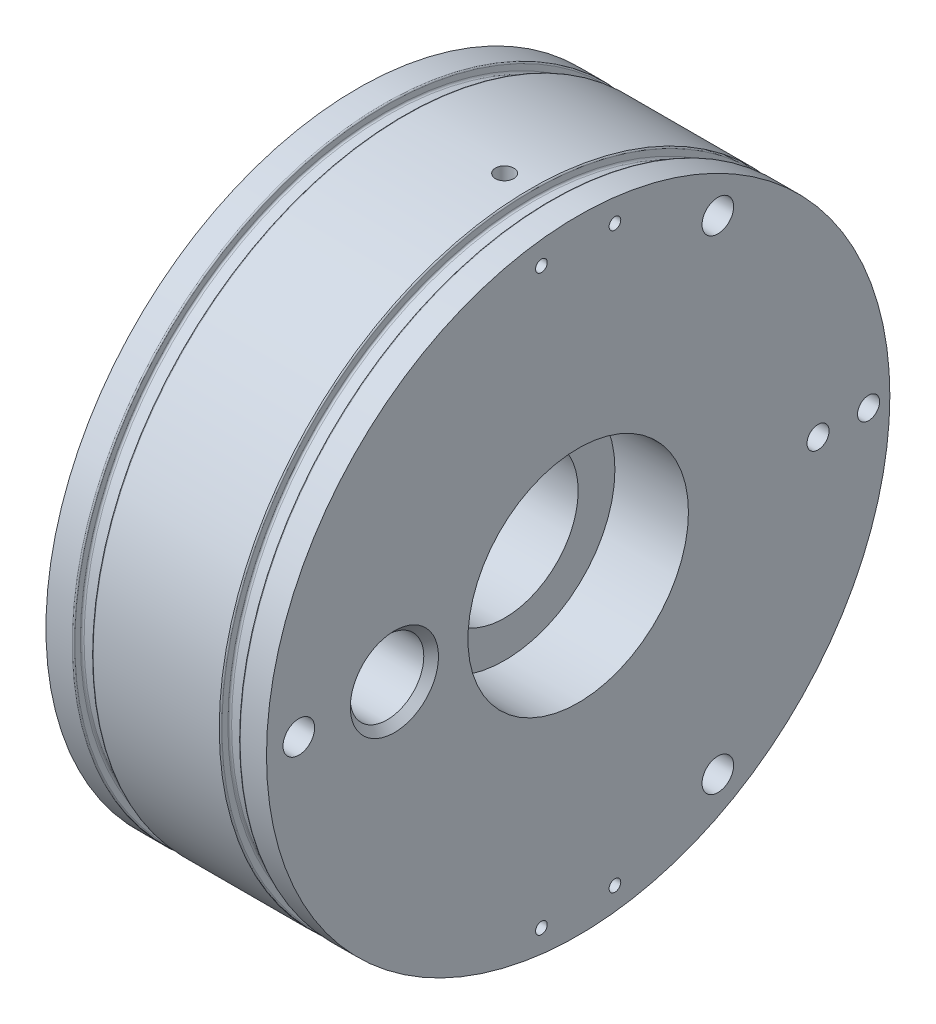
ISO-10303-21;
HEADER;
FILE_DESCRIPTION(('STEP AP214'),'2;1');
FILE_NAME('part.step','',(''),(''),'','','');
FILE_SCHEMA(('AUTOMOTIVE_DESIGN { 1 0 10303 214 1 1 1 1 }'));
ENDSEC;
DATA;
#1=APPLICATION_CONTEXT('core data for automotive mechanical design processes');
#2=APPLICATION_PROTOCOL_DEFINITION('international standard','automotive_design',2000,#1);
#3=PRODUCT_CONTEXT('',#1,'mechanical');
#4=PRODUCT('Part','Part','',(#3));
#5=PRODUCT_RELATED_PRODUCT_CATEGORY('part','',(#4));
#6=PRODUCT_DEFINITION_FORMATION('','',#4);
#7=PRODUCT_DEFINITION_CONTEXT('part definition',#1,'design');
#8=PRODUCT_DEFINITION('design','',#6,#7);
#9=PRODUCT_DEFINITION_SHAPE('','',#8);
#10=(LENGTH_UNIT() NAMED_UNIT(*) SI_UNIT(.MILLI.,.METRE.));
#11=(NAMED_UNIT(*) PLANE_ANGLE_UNIT() SI_UNIT($,.RADIAN.));
#12=(NAMED_UNIT(*) SI_UNIT($,.STERADIAN.) SOLID_ANGLE_UNIT());
#13=UNCERTAINTY_MEASURE_WITH_UNIT(LENGTH_MEASURE(1.E-05),#10,'distance_accuracy_value','');
#14=(GEOMETRIC_REPRESENTATION_CONTEXT(3) GLOBAL_UNCERTAINTY_ASSIGNED_CONTEXT((#13)) GLOBAL_UNIT_ASSIGNED_CONTEXT((#10,
#11,#12)) REPRESENTATION_CONTEXT('',''));
#15=CARTESIAN_POINT('',(0.,0.,0.));
#16=DIRECTION('',(0.,0.,1.));
#17=DIRECTION('',(1.,0.,0.));
#18=AXIS2_PLACEMENT_3D('',#15,#16,#17);
#19=CARTESIAN_POINT('',(30.,0.,0.));
#20=DIRECTION('',(-1.,0.,0.));
#21=DIRECTION('',(0.,0.,1.));
#22=AXIS2_PLACEMENT_3D('',#19,#20,#21);
#23=CYLINDRICAL_SURFACE('',#22,42.4);
#24=CARTESIAN_POINT('',(3.57779637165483,0.,0.));
#25=DIRECTION('',(1.,0.,0.));
#26=DIRECTION('',(0.,0.,-1.));
#27=AXIS2_PLACEMENT_3D('',#24,#25,#26);
#28=CIRCLE('',#27,42.4);
#29=CARTESIAN_POINT('',(3.57779637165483,0.,-42.4));
#30=VERTEX_POINT('',#29);
#31=EDGE_CURVE('E191',#30,#30,#28,.F.);
#32=ORIENTED_EDGE('',*,*,#31,.T.);
#33=EDGE_LOOP('',(#32));
#34=FACE_BOUND('',#33,.T.);
#35=CARTESIAN_POINT('',(0.,0.,0.));
#36=DIRECTION('',(1.,0.,0.));
#37=DIRECTION('',(0.,0.,-1.));
#38=AXIS2_PLACEMENT_3D('',#35,#36,#37);
#39=CIRCLE('',#38,42.4);
#40=CARTESIAN_POINT('',(0.,0.,-42.4));
#41=VERTEX_POINT('',#40);
#42=EDGE_CURVE('E144',#41,#41,#39,.T.);
#43=ORIENTED_EDGE('',*,*,#42,.T.);
#44=EDGE_LOOP('',(#43));
#45=FACE_BOUND('',#44,.T.);
#46=ADVANCED_FACE('F36',(#34,#45),#23,.T.);
#47=CARTESIAN_POINT('',(20.,1.25000000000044,-42.3815702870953));
#48=CARTESIAN_POINT('',(19.9298033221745,1.24999689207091,-42.3815705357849));
#49=CARTESIAN_POINT('',(19.8595561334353,1.24406706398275,-42.3817465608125));
#50=CARTESIAN_POINT('',(19.7209975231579,1.22049471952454,-42.3824318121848));
#51=CARTESIAN_POINT('',(19.6526885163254,1.20283820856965,-42.3829414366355));
#52=CARTESIAN_POINT('',(19.5200336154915,1.15631658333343,-42.3842361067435));
#53=CARTESIAN_POINT('',(19.4556858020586,1.1274569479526,-42.3850210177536));
#54=CARTESIAN_POINT('',(19.3327662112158,1.05935613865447,-42.3867776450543));
#55=CARTESIAN_POINT('',(19.2741930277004,1.02011750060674,-42.3877493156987));
#56=CARTESIAN_POINT('',(19.1644412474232,0.932351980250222,-42.3897704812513));
#57=CARTESIAN_POINT('',(19.1132654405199,0.883821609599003,-42.3908200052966));
#58=CARTESIAN_POINT('',(19.0197845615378,0.778856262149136,-42.3928783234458));
#59=CARTESIAN_POINT('',(18.9774798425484,0.722420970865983,-42.3938871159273));
#60=CARTESIAN_POINT('',(18.9029378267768,0.603237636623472,-42.3957503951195));
#61=CARTESIAN_POINT('',(18.8707021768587,0.54048856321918,-42.3966048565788));
#62=CARTESIAN_POINT('',(18.8172240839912,0.410466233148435,-42.3980629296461));
#63=CARTESIAN_POINT('',(18.7959815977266,0.343192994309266,-42.3986665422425));
#64=CARTESIAN_POINT('',(18.7650987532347,0.206052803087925,-42.3995547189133));
#65=CARTESIAN_POINT('',(18.7554550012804,0.136186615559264,-42.3998393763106));
#66=CARTESIAN_POINT('',(18.7480329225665,-0.00417353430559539,-42.400057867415));
#67=CARTESIAN_POINT('',(18.7502545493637,-0.074667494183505,-42.3999917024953));
#68=CARTESIAN_POINT('',(18.7664972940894,-0.214259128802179,-42.3995160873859));
#69=CARTESIAN_POINT('',(18.7805147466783,-0.283357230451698,-42.3991067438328));
#70=CARTESIAN_POINT('',(18.819945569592,-0.418219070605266,-42.3979910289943));
#71=CARTESIAN_POINT('',(18.8453589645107,-0.483982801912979,-42.3972846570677));
#72=CARTESIAN_POINT('',(18.9068644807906,-0.610320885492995,-42.3956543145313));
#73=CARTESIAN_POINT('',(18.9429582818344,-0.67089441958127,-42.3947303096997));
#74=CARTESIAN_POINT('',(19.0247987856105,-0.785123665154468,-42.392768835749));
#75=CARTESIAN_POINT('',(19.0705455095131,-0.838779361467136,-42.3917313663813));
#76=CARTESIAN_POINT('',(19.1704140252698,-0.937671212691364,-42.3896594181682));
#77=CARTESIAN_POINT('',(19.2245389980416,-0.982904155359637,-42.3886249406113));
#78=CARTESIAN_POINT('',(19.3396163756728,-1.06364176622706,-42.3866760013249));
#79=CARTESIAN_POINT('',(19.4005687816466,-1.09914643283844,-42.3857615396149));
#80=CARTESIAN_POINT('',(19.5275726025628,-1.15941928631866,-42.3841557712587));
#81=CARTESIAN_POINT('',(19.5936240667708,-1.18418736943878,-42.3834644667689));
#82=CARTESIAN_POINT('',(19.7289502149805,-1.22228191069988,-42.3823830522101));
#83=CARTESIAN_POINT('',(19.7982248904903,-1.23560839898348,-42.3819929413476));
#84=CARTESIAN_POINT('',(19.9380030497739,-1.25043751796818,-42.3815580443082));
#85=CARTESIAN_POINT('',(20.0085060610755,-1.25194459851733,-42.3815131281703));
#86=CARTESIAN_POINT('',(20.1487640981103,-1.24310371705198,-42.3817733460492));
#87=CARTESIAN_POINT('',(20.2185191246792,-1.23275576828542,-42.3820784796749));
#88=CARTESIAN_POINT('',(20.3552886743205,-1.20050225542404,-42.3830042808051));
#89=CARTESIAN_POINT('',(20.4223036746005,-1.17859871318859,-42.3836248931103));
#90=CARTESIAN_POINT('',(20.55170549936,-1.12385782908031,-42.3851116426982));
#91=CARTESIAN_POINT('',(20.6140923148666,-1.09102046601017,-42.385977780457));
#92=CARTESIAN_POINT('',(20.7324873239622,-1.01533260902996,-42.3878582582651));
#93=CARTESIAN_POINT('',(20.7884936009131,-0.9724791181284,-42.3888726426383));
#94=CARTESIAN_POINT('',(20.8925184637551,-0.877979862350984,-42.390935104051));
#95=CARTESIAN_POINT('',(20.9405370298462,-0.826334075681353,-42.391983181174));
#96=CARTESIAN_POINT('',(21.0272382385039,-0.715697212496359,-42.393995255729));
#97=CARTESIAN_POINT('',(21.0659180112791,-0.656703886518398,-42.3949592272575));
#98=CARTESIAN_POINT('',(21.1328240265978,-0.533058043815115,-42.3966940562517));
#99=CARTESIAN_POINT('',(21.1610502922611,-0.468405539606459,-42.3974649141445));
#100=CARTESIAN_POINT('',(21.2062430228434,-0.335287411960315,-42.398726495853));
#101=CARTESIAN_POINT('',(21.2232113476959,-0.266822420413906,-42.3992172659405));
#102=CARTESIAN_POINT('',(21.2454126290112,-0.128013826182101,-42.3998635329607));
#103=CARTESIAN_POINT('',(21.2506455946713,-0.05767022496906,-42.4000190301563));
#104=CARTESIAN_POINT('',(21.2492273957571,0.0828700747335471,-42.3999772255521));
#105=CARTESIAN_POINT('',(21.2425807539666,0.153066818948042,-42.3997800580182));
#106=CARTESIAN_POINT('',(21.217601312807,0.291347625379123,-42.3990554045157));
#107=CARTESIAN_POINT('',(21.1992684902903,0.359431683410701,-42.3985279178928));
#108=CARTESIAN_POINT('',(21.1514376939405,0.491556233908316,-42.397202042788));
#109=CARTESIAN_POINT('',(21.1219395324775,0.555596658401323,-42.3964036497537));
#110=CARTESIAN_POINT('',(21.0526170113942,0.67781480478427,-42.394625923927));
#111=CARTESIAN_POINT('',(21.0127930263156,0.735992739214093,-42.3936465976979));
#112=CARTESIAN_POINT('',(20.9239361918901,0.844855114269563,-42.3916169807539));
#113=CARTESIAN_POINT('',(20.8749008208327,0.895537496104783,-42.3905666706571));
#114=CARTESIAN_POINT('',(20.7690030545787,0.987964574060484,-42.3885134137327));
#115=CARTESIAN_POINT('',(20.7121387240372,1.02970705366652,-42.387510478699));
#116=CARTESIAN_POINT('',(20.592175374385,1.10307627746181,-42.3856647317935));
#117=CARTESIAN_POINT('',(20.5290723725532,1.13469650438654,-42.3848220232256));
#118=CARTESIAN_POINT('',(20.398499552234,1.18685692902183,-42.3833936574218));
#119=CARTESIAN_POINT('',(20.3310350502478,1.20741034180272,-42.3828076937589));
#120=CARTESIAN_POINT('',(20.2192868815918,1.23140579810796,-42.3821155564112));
#121=CARTESIAN_POINT('',(20.1757285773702,1.23836985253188,-42.3819119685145));
#122=CARTESIAN_POINT('',(20.0881201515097,1.24766792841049,-42.381639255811));
#123=CARTESIAN_POINT('',(20.0440700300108,1.25000195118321,-42.381570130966));
#124=CARTESIAN_POINT('',(20.,1.25000000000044,-42.3815702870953));
#125=B_SPLINE_CURVE_WITH_KNOTS('',3,(#47,#48,#49,#50,#51,#52,#53,#54,#55,#56,#57,#58,#59,#60,
#61,#62,#63,#64,#65,#66,#67,#68,#69,#70,#71,#72,#73,#74,#75,#76,#77,#78,#79,#80,#81,#82,#83,#84,
#85,#86,#87,#88,#89,#90,#91,#92,#93,#94,#95,#96,#97,#98,#99,#100,#101,#102,#103,#104,#105,#106,
#107,#108,#109,#110,#111,#112,#113,#114,#115,#116,#117,#118,#119,#120,#121,#122,#123,#124),
.UNSPECIFIED.,.T.,.F.,(4,2,2,2,2,2,2,2,2,2,2,2,2,2,2,2,2,2,2,2,2,2,2,2,2,2,2,2,2,2,2,2,2,2,2,2,
2,2,4),(0.,0.210429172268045,0.421109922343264,0.631687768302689,0.842214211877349,
1.05281984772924,1.26343386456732,1.4740823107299,1.68472992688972,1.8953158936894,
2.10590103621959,2.3164207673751,2.52694095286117,2.7374942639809,2.94804803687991,
3.15868194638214,3.36931589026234,3.57995186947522,3.79058729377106,4.00114341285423,
4.2116992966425,4.42221835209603,4.63273781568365,4.84332035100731,5.05390340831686,
5.26455109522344,5.4751983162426,5.68581072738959,5.8964229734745,6.10695505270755,
6.31748754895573,6.52802358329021,6.73855198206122,6.94913809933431,7.15977636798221,
7.37054998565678,7.58107135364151,7.71318049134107,7.84528959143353),.UNSPECIFIED.);
#126=CARTESIAN_POINT('',(20.,1.25000000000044,-42.3815702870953));
#127=VERTEX_POINT('',#126);
#128=EDGE_CURVE('E11',#127,#127,#125,.T.);
#129=ORIENTED_EDGE('',*,*,#128,.T.);
#130=EDGE_LOOP('',(#129));
#131=FACE_BOUND('',#130,.T.);
#132=CARTESIAN_POINT('',(20.,42.3815702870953,1.25));
#133=CARTESIAN_POINT('',(19.9298033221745,42.381570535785,1.24999689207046));
#134=CARTESIAN_POINT('',(19.8595561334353,42.3817465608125,1.2440670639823));
#135=CARTESIAN_POINT('',(19.7209975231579,42.3824318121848,1.22049471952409));
#136=CARTESIAN_POINT('',(19.6526885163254,42.3829414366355,1.20283820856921));
#137=CARTESIAN_POINT('',(19.5200336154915,42.3842361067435,1.15631658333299));
#138=CARTESIAN_POINT('',(19.4556858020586,42.3850210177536,1.12745694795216));
#139=CARTESIAN_POINT('',(19.3327662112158,42.3867776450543,1.05935613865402));
#140=CARTESIAN_POINT('',(19.2741930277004,42.3877493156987,1.02011750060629));
#141=CARTESIAN_POINT('',(19.1644412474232,42.3897704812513,0.932351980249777));
#142=CARTESIAN_POINT('',(19.1132654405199,42.3908200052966,0.883821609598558));
#143=CARTESIAN_POINT('',(19.0197845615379,42.3928783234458,0.778856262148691));
#144=CARTESIAN_POINT('',(18.9774798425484,42.3938871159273,0.722420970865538));
#145=CARTESIAN_POINT('',(18.9029378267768,42.3957503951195,0.603237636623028));
#146=CARTESIAN_POINT('',(18.8707021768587,42.3966048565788,0.540488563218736));
#147=CARTESIAN_POINT('',(18.8172240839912,42.3980629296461,0.410466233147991));
#148=CARTESIAN_POINT('',(18.7959815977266,42.3986665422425,0.343192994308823));
#149=CARTESIAN_POINT('',(18.7650987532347,42.3995547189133,0.206052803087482));
#150=CARTESIAN_POINT('',(18.7554550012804,42.3998393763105,0.136186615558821));
#151=CARTESIAN_POINT('',(18.7480329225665,42.400057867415,-0.00417353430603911));
#152=CARTESIAN_POINT('',(18.7502545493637,42.3999917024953,-0.074667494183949));
#153=CARTESIAN_POINT('',(18.7664972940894,42.3995160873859,-0.214259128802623));
#154=CARTESIAN_POINT('',(18.7805147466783,42.3991067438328,-0.283357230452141));
#155=CARTESIAN_POINT('',(18.819945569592,42.3979910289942,-0.41821907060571));
#156=CARTESIAN_POINT('',(18.8453589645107,42.3972846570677,-0.483982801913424));
#157=CARTESIAN_POINT('',(18.9068644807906,42.3956543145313,-0.610320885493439));
#158=CARTESIAN_POINT('',(18.9429582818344,42.3947303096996,-0.670894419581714));
#159=CARTESIAN_POINT('',(19.0247987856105,42.392768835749,-0.785123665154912));
#160=CARTESIAN_POINT('',(19.0705455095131,42.3917313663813,-0.83877936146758));
#161=CARTESIAN_POINT('',(19.1704140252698,42.3896594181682,-0.937671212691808));
#162=CARTESIAN_POINT('',(19.2245389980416,42.3886249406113,-0.982904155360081));
#163=CARTESIAN_POINT('',(19.3396163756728,42.3866760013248,-1.0636417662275));
#164=CARTESIAN_POINT('',(19.4005687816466,42.3857615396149,-1.09914643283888));
#165=CARTESIAN_POINT('',(19.5275726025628,42.3841557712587,-1.15941928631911));
#166=CARTESIAN_POINT('',(19.5936240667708,42.3834644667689,-1.18418736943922));
#167=CARTESIAN_POINT('',(19.7289502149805,42.3823830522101,-1.22228191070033));
#168=CARTESIAN_POINT('',(19.7982248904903,42.3819929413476,-1.23560839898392));
#169=CARTESIAN_POINT('',(19.9380030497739,42.3815580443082,-1.25043751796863));
#170=CARTESIAN_POINT('',(20.0085060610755,42.3815131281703,-1.25194459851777));
#171=CARTESIAN_POINT('',(20.1487640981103,42.3817733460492,-1.24310371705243));
#172=CARTESIAN_POINT('',(20.2185191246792,42.3820784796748,-1.23275576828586));
#173=CARTESIAN_POINT('',(20.3552886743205,42.383004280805,-1.20050225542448));
#174=CARTESIAN_POINT('',(20.4223036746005,42.3836248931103,-1.17859871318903));
#175=CARTESIAN_POINT('',(20.55170549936,42.3851116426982,-1.12385782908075));
#176=CARTESIAN_POINT('',(20.6140923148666,42.385977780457,-1.09102046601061));
#177=CARTESIAN_POINT('',(20.7324873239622,42.3878582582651,-1.0153326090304));
#178=CARTESIAN_POINT('',(20.7884936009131,42.3888726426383,-0.972479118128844));
#179=CARTESIAN_POINT('',(20.8925184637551,42.390935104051,-0.877979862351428));
#180=CARTESIAN_POINT('',(20.9405370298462,42.391983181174,-0.826334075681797));
#181=CARTESIAN_POINT('',(21.0272382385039,42.393995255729,-0.715697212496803));
#182=CARTESIAN_POINT('',(21.0659180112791,42.3949592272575,-0.656703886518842));
#183=CARTESIAN_POINT('',(21.1328240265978,42.3966940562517,-0.533058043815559));
#184=CARTESIAN_POINT('',(21.1610502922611,42.3974649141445,-0.468405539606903));
#185=CARTESIAN_POINT('',(21.2062430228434,42.398726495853,-0.335287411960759));
#186=CARTESIAN_POINT('',(21.2232113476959,42.3992172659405,-0.26682242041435));
#187=CARTESIAN_POINT('',(21.2454126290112,42.3998635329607,-0.128013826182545));
#188=CARTESIAN_POINT('',(21.2506455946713,42.4000190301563,-0.0576702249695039));
#189=CARTESIAN_POINT('',(21.2492273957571,42.3999772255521,0.0828700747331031));
#190=CARTESIAN_POINT('',(21.2425807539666,42.3997800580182,0.153066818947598));
#191=CARTESIAN_POINT('',(21.217601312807,42.3990554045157,0.291347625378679));
#192=CARTESIAN_POINT('',(21.1992684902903,42.3985279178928,0.359431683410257));
#193=CARTESIAN_POINT('',(21.1514376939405,42.3972020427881,0.491556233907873));
#194=CARTESIAN_POINT('',(21.1219395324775,42.3964036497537,0.555596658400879));
#195=CARTESIAN_POINT('',(21.0526170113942,42.394625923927,0.677814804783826));
#196=CARTESIAN_POINT('',(21.0127930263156,42.3936465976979,0.735992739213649));
#197=CARTESIAN_POINT('',(20.9239361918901,42.3916169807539,0.844855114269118));
#198=CARTESIAN_POINT('',(20.8749008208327,42.3905666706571,0.895537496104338));
#199=CARTESIAN_POINT('',(20.7690030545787,42.3885134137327,0.987964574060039));
#200=CARTESIAN_POINT('',(20.7121387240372,42.387510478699,1.02970705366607));
#201=CARTESIAN_POINT('',(20.592175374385,42.3856647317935,1.10307627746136));
#202=CARTESIAN_POINT('',(20.5290723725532,42.3848220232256,1.1346965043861));
#203=CARTESIAN_POINT('',(20.398499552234,42.3833936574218,1.18685692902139));
#204=CARTESIAN_POINT('',(20.3310350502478,42.3828076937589,1.20741034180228));
#205=CARTESIAN_POINT('',(20.2192868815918,42.3821155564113,1.23140579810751));
#206=CARTESIAN_POINT('',(20.1757285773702,42.3819119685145,1.23836985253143));
#207=CARTESIAN_POINT('',(20.0881201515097,42.381639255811,1.24766792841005));
#208=CARTESIAN_POINT('',(20.0440700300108,42.381570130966,1.25000195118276));
#209=CARTESIAN_POINT('',(20.,42.3815702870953,1.25));
#210=B_SPLINE_CURVE_WITH_KNOTS('',3,(#132,#133,#134,#135,#136,#137,#138,#139,#140,#141,#142,
#143,#144,#145,#146,#147,#148,#149,#150,#151,#152,#153,#154,#155,#156,#157,#158,#159,#160,#161,
#162,#163,#164,#165,#166,#167,#168,#169,#170,#171,#172,#173,#174,#175,#176,#177,#178,#179,#180,
#181,#182,#183,#184,#185,#186,#187,#188,#189,#190,#191,#192,#193,#194,#195,#196,#197,#198,#199,
#200,#201,#202,#203,#204,#205,#206,#207,#208,#209),.UNSPECIFIED.,.T.,.F.,(4,2,2,2,2,2,2,2,2,2,2,
2,2,2,2,2,2,2,2,2,2,2,2,2,2,2,2,2,2,2,2,2,2,2,2,2,2,2,4),(0.,0.210429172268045,
0.421109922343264,0.631687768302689,0.842214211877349,1.05281984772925,1.26343386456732,
1.4740823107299,1.68472992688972,1.8953158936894,2.10590103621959,2.3164207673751,
2.52694095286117,2.7374942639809,2.94804803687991,3.15868194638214,3.36931589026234,
3.57995186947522,3.79058729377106,4.00114341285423,4.2116992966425,4.42221835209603,
4.63273781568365,4.84332035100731,5.05390340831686,5.26455109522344,5.4751983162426,
5.68581072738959,5.8964229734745,6.10695505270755,6.31748754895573,6.52802358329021,
6.73855198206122,6.94913809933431,7.15977636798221,7.37054998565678,7.58107135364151,
7.71318049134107,7.84528959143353),.UNSPECIFIED.);
#211=CARTESIAN_POINT('',(20.,42.3815702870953,1.25));
#212=VERTEX_POINT('',#211);
#213=EDGE_CURVE('E48',#212,#212,#210,.T.);
#214=ORIENTED_EDGE('',*,*,#213,.T.);
#215=EDGE_LOOP('',(#214));
#216=FACE_BOUND('',#215,.T.);
#217=CARTESIAN_POINT('',(23.5777,0.,0.));
#218=DIRECTION('',(1.,0.,0.));
#219=DIRECTION('',(0.,0.,-1.));
#220=AXIS2_PLACEMENT_3D('',#217,#218,#219);
#221=CIRCLE('',#220,42.4);
#222=CARTESIAN_POINT('',(23.5777,0.,-42.4));
#223=VERTEX_POINT('',#222);
#224=EDGE_CURVE('E182',#223,#223,#221,.F.);
#225=ORIENTED_EDGE('',*,*,#224,.T.);
#226=EDGE_LOOP('',(#225));
#227=FACE_BOUND('',#226,.T.);
#228=CARTESIAN_POINT('',(6.42239637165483,0.,0.));
#229=DIRECTION('',(-1.,0.,0.));
#230=DIRECTION('',(0.,0.,1.));
#231=AXIS2_PLACEMENT_3D('',#228,#229,#230);
#232=CIRCLE('',#231,42.4);
#233=CARTESIAN_POINT('',(6.42239637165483,0.,42.4));
#234=VERTEX_POINT('',#233);
#235=EDGE_CURVE('E179',#234,#234,#232,.F.);
#236=ORIENTED_EDGE('',*,*,#235,.T.);
#237=EDGE_LOOP('',(#236));
#238=FACE_BOUND('',#237,.T.);
#239=ADVANCED_FACE('F323',(#131,#216,#227,#238),#23,.T.);
#240=CARTESIAN_POINT('',(26.4223,0.,0.));
#241=DIRECTION('',(-1.,0.,0.));
#242=DIRECTION('',(0.,0.,1.));
#243=AXIS2_PLACEMENT_3D('',#240,#241,#242);
#244=CIRCLE('',#243,42.4);
#245=CARTESIAN_POINT('',(26.4223,0.,42.4));
#246=VERTEX_POINT('',#245);
#247=EDGE_CURVE('E173',#246,#246,#244,.F.);
#248=ORIENTED_EDGE('',*,*,#247,.T.);
#249=EDGE_LOOP('',(#248));
#250=FACE_BOUND('',#249,.T.);
#251=CARTESIAN_POINT('',(30.,0.,0.));
#252=DIRECTION('',(1.,0.,0.));
#253=DIRECTION('',(0.,0.,-1.));
#254=AXIS2_PLACEMENT_3D('',#251,#252,#253);
#255=CIRCLE('',#254,42.4);
#256=CARTESIAN_POINT('',(30.,0.,-42.4));
#257=VERTEX_POINT('',#256);
#258=EDGE_CURVE('E145',#257,#257,#255,.T.);
#259=ORIENTED_EDGE('',*,*,#258,.F.);
#260=EDGE_LOOP('',(#259));
#261=FACE_BOUND('',#260,.T.);
#262=ADVANCED_FACE('F312',(#250,#261),#23,.T.);
#263=CARTESIAN_POINT('',(0.,0.,0.));
#264=DIRECTION('',(1.,0.,0.));
#265=DIRECTION('',(0.,0.,-1.));
#266=AXIS2_PLACEMENT_3D('',#263,#264,#265);
#267=CYLINDRICAL_SURFACE('',#266,10.);
#268=CARTESIAN_POINT('',(0.,0.,0.));
#269=DIRECTION('',(1.,0.,0.));
#270=DIRECTION('',(0.,0.,-1.));
#271=AXIS2_PLACEMENT_3D('',#268,#269,#270);
#272=CIRCLE('',#271,10.);
#273=CARTESIAN_POINT('',(0.,0.,-10.));
#274=VERTEX_POINT('',#273);
#275=EDGE_CURVE('E138',#274,#274,#272,.T.);
#276=ORIENTED_EDGE('',*,*,#275,.F.);
#277=EDGE_LOOP('',(#276));
#278=FACE_BOUND('',#277,.T.);
#279=CARTESIAN_POINT('',(20.,0.,0.));
#280=DIRECTION('',(1.,0.,0.));
#281=DIRECTION('',(0.,0.,-1.));
#282=AXIS2_PLACEMENT_3D('',#279,#280,#281);
#283=CIRCLE('',#282,10.);
#284=CARTESIAN_POINT('',(20.,0.,-10.));
#285=VERTEX_POINT('',#284);
#286=EDGE_CURVE('E102',#285,#285,#283,.F.);
#287=ORIENTED_EDGE('',*,*,#286,.F.);
#288=EDGE_LOOP('',(#287));
#289=FACE_BOUND('',#288,.T.);
#290=ADVANCED_FACE('F308',(#278,#289),#267,.F.);
#291=CARTESIAN_POINT('',(30.,0.,0.));
#292=DIRECTION('',(1.,0.,0.));
#293=DIRECTION('',(0.,0.,-1.));
#294=AXIS2_PLACEMENT_3D('',#291,#292,#293);
#295=PLANE('',#294);
#296=CARTESIAN_POINT('',(30.,39.,-4.99999999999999));
#297=DIRECTION('',(1.,0.,0.));
#298=DIRECTION('',(0.,0.,-1.));
#299=AXIS2_PLACEMENT_3D('',#296,#297,#298);
#300=CIRCLE('',#299,0.793749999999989);
#301=CARTESIAN_POINT('',(30.,39.,-5.79374999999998));
#302=VERTEX_POINT('',#301);
#303=EDGE_CURVE('E718',#302,#302,#300,.T.);
#304=ORIENTED_EDGE('',*,*,#303,.F.);
#305=EDGE_LOOP('',(#304));
#306=FACE_BOUND('',#305,.T.);
#307=CARTESIAN_POINT('',(30.,39.,5.00000000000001));
#308=DIRECTION('',(1.,0.,0.));
#309=DIRECTION('',(0.,0.,-1.));
#310=AXIS2_PLACEMENT_3D('',#307,#308,#309);
#311=CIRCLE('',#310,0.793749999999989);
#312=CARTESIAN_POINT('',(30.,39.,4.20625000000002));
#313=VERTEX_POINT('',#312);
#314=EDGE_CURVE('E720',#313,#313,#311,.T.);
#315=ORIENTED_EDGE('',*,*,#314,.F.);
#316=EDGE_LOOP('',(#315));
#317=FACE_BOUND('',#316,.T.);
#318=CARTESIAN_POINT('',(30.,0.,-39.5));
#319=DIRECTION('',(1.,0.,0.));
#320=DIRECTION('',(0.,0.,-1.));
#321=AXIS2_PLACEMENT_3D('',#318,#319,#320);
#322=CIRCLE('',#321,1.5);
#323=CARTESIAN_POINT('',(30.,0.,-41.));
#324=VERTEX_POINT('',#323);
#325=EDGE_CURVE('E728',#324,#324,#322,.T.);
#326=ORIENTED_EDGE('',*,*,#325,.F.);
#327=EDGE_LOOP('',(#326));
#328=FACE_BOUND('',#327,.T.);
#329=CARTESIAN_POINT('',(30.,-39.,4.99999999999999));
#330=DIRECTION('',(1.,0.,0.));
#331=DIRECTION('',(0.,0.,-1.));
#332=AXIS2_PLACEMENT_3D('',#329,#330,#331);
#333=CIRCLE('',#332,0.793749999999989);
#334=CARTESIAN_POINT('',(30.,-39.,4.20625000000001));
#335=VERTEX_POINT('',#334);
#336=EDGE_CURVE('E732',#335,#335,#333,.T.);
#337=ORIENTED_EDGE('',*,*,#336,.F.);
#338=EDGE_LOOP('',(#337));
#339=FACE_BOUND('',#338,.T.);
#340=CARTESIAN_POINT('',(30.,-39.,-5.00000000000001));
#341=DIRECTION('',(1.,0.,0.));
#342=DIRECTION('',(0.,0.,-1.));
#343=AXIS2_PLACEMENT_3D('',#340,#341,#342);
#344=CIRCLE('',#343,0.793749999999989);
#345=CARTESIAN_POINT('',(30.,-39.,-5.79374999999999));
#346=VERTEX_POINT('',#345);
#347=EDGE_CURVE('E71',#346,#346,#344,.T.);
#348=ORIENTED_EDGE('',*,*,#347,.F.);
#349=EDGE_LOOP('',(#348));
#350=FACE_BOUND('',#349,.T.);
#351=CARTESIAN_POINT('',(30.,0.,0.));
#352=DIRECTION('',(1.,0.,0.));
#353=DIRECTION('',(0.,0.,-1.));
#354=AXIS2_PLACEMENT_3D('',#351,#352,#353);
#355=CIRCLE('',#354,15.);
#356=CARTESIAN_POINT('',(30.,0.,-15.));
#357=VERTEX_POINT('',#356);
#358=EDGE_CURVE('E98',#357,#357,#355,.T.);
#359=ORIENTED_EDGE('',*,*,#358,.F.);
#360=EDGE_LOOP('',(#359));
#361=FACE_BOUND('',#360,.T.);
#362=CARTESIAN_POINT('',(30.,0.,-32.63));
#363=DIRECTION('',(1.,0.,0.));
#364=DIRECTION('',(0.,0.,-1.));
#365=AXIS2_PLACEMENT_3D('',#362,#363,#364);
#366=CIRCLE('',#365,1.5);
#367=CARTESIAN_POINT('',(30.,0.,-34.13));
#368=VERTEX_POINT('',#367);
#369=EDGE_CURVE('E109',#368,#368,#366,.T.);
#370=ORIENTED_EDGE('',*,*,#369,.F.);
#371=EDGE_LOOP('',(#370));
#372=FACE_BOUND('',#371,.T.);
#373=CARTESIAN_POINT('',(30.,0.,25.));
#374=DIRECTION('',(1.,0.,0.));
#375=DIRECTION('',(0.,0.,-1.));
#376=AXIS2_PLACEMENT_3D('',#373,#374,#375);
#377=CIRCLE('',#376,6.00000000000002);
#378=CARTESIAN_POINT('',(30.,0.,19.));
#379=VERTEX_POINT('',#378);
#380=EDGE_CURVE('E162',#379,#379,#377,.F.);
#381=ORIENTED_EDGE('',*,*,#380,.T.);
#382=EDGE_LOOP('',(#381));
#383=FACE_BOUND('',#382,.T.);
#384=CARTESIAN_POINT('',(30.,-32.9089653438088,-18.9999999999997));
#385=DIRECTION('',(1.,0.,0.));
#386=DIRECTION('',(0.,0.,-1.));
#387=AXIS2_PLACEMENT_3D('',#384,#385,#386);
#388=CIRCLE('',#387,2.14999999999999);
#389=CARTESIAN_POINT('',(30.,-32.9089653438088,-21.1499999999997));
#390=VERTEX_POINT('',#389);
#391=EDGE_CURVE('E108',#390,#390,#388,.T.);
#392=ORIENTED_EDGE('',*,*,#391,.F.);
#393=EDGE_LOOP('',(#392));
#394=FACE_BOUND('',#393,.T.);
#395=CARTESIAN_POINT('',(30.,32.9089653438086,-19.0000000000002));
#396=DIRECTION('',(1.,0.,0.));
#397=DIRECTION('',(0.,0.,-1.));
#398=AXIS2_PLACEMENT_3D('',#395,#396,#397);
#399=CIRCLE('',#398,2.14999999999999);
#400=CARTESIAN_POINT('',(30.,32.9089653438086,-21.1500000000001));
#401=VERTEX_POINT('',#400);
#402=EDGE_CURVE('E115',#401,#401,#399,.T.);
#403=ORIENTED_EDGE('',*,*,#402,.F.);
#404=EDGE_LOOP('',(#403));
#405=FACE_BOUND('',#404,.T.);
#406=CARTESIAN_POINT('',(30.,0.,38.));
#407=DIRECTION('',(1.,0.,0.));
#408=DIRECTION('',(0.,0.,-1.));
#409=AXIS2_PLACEMENT_3D('',#406,#407,#408);
#410=CIRCLE('',#409,2.14999999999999);
#411=CARTESIAN_POINT('',(30.,0.,35.85));
#412=VERTEX_POINT('',#411);
#413=EDGE_CURVE('E129',#412,#412,#410,.T.);
#414=ORIENTED_EDGE('',*,*,#413,.F.);
#415=EDGE_LOOP('',(#414));
#416=FACE_BOUND('',#415,.T.);
#417=ORIENTED_EDGE('',*,*,#258,.T.);
#418=EDGE_LOOP('',(#417));
#419=FACE_BOUND('',#418,.T.);
#420=ADVANCED_FACE('F311',(#306,#317,#328,#339,#350,#361,#372,#383,#394,#405,#416,#419),#295,.T.);
#421=CARTESIAN_POINT('',(0.,0.,0.));
#422=DIRECTION('',(1.,0.,0.));
#423=DIRECTION('',(0.,0.,-1.));
#424=AXIS2_PLACEMENT_3D('',#421,#422,#423);
#425=PLANE('',#424);
#426=CARTESIAN_POINT('',(0.,39.,-4.99999999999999));
#427=DIRECTION('',(1.,0.,0.));
#428=DIRECTION('',(0.,0.,-1.));
#429=AXIS2_PLACEMENT_3D('',#426,#427,#428);
#430=CIRCLE('',#429,0.793749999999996);
#431=CARTESIAN_POINT('',(0.,39.,-5.79374999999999));
#432=VERTEX_POINT('',#431);
#433=EDGE_CURVE('E715',#432,#432,#430,.T.);
#434=ORIENTED_EDGE('',*,*,#433,.T.);
#435=EDGE_LOOP('',(#434));
#436=FACE_BOUND('',#435,.T.);
#437=CARTESIAN_POINT('',(0.,39.,5.00000000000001));
#438=DIRECTION('',(1.,0.,0.));
#439=DIRECTION('',(0.,0.,-1.));
#440=AXIS2_PLACEMENT_3D('',#437,#438,#439);
#441=CIRCLE('',#440,0.793749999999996);
#442=CARTESIAN_POINT('',(0.,39.,4.20625000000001));
#443=VERTEX_POINT('',#442);
#444=EDGE_CURVE('E725',#443,#443,#441,.T.);
#445=ORIENTED_EDGE('',*,*,#444,.T.);
#446=EDGE_LOOP('',(#445));
#447=FACE_BOUND('',#446,.T.);
#448=CARTESIAN_POINT('',(0.,-39.,4.99999999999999));
#449=DIRECTION('',(1.,0.,0.));
#450=DIRECTION('',(0.,0.,-1.));
#451=AXIS2_PLACEMENT_3D('',#448,#449,#450);
#452=CIRCLE('',#451,0.793749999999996);
#453=CARTESIAN_POINT('',(0.,-39.,4.20625));
#454=VERTEX_POINT('',#453);
#455=EDGE_CURVE('E737',#454,#454,#452,.T.);
#456=ORIENTED_EDGE('',*,*,#455,.T.);
#457=EDGE_LOOP('',(#456));
#458=FACE_BOUND('',#457,.T.);
#459=CARTESIAN_POINT('',(0.,-39.,-5.00000000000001));
#460=DIRECTION('',(1.,0.,0.));
#461=DIRECTION('',(0.,0.,-1.));
#462=AXIS2_PLACEMENT_3D('',#459,#460,#461);
#463=CIRCLE('',#462,0.793749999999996);
#464=CARTESIAN_POINT('',(0.,-39.,-5.79375));
#465=VERTEX_POINT('',#464);
#466=EDGE_CURVE('E65',#465,#465,#463,.T.);
#467=ORIENTED_EDGE('',*,*,#466,.T.);
#468=EDGE_LOOP('',(#467));
#469=FACE_BOUND('',#468,.T.);
#470=CARTESIAN_POINT('',(0.,0.,25.));
#471=DIRECTION('',(1.,0.,0.));
#472=DIRECTION('',(0.,0.,-1.));
#473=AXIS2_PLACEMENT_3D('',#470,#471,#472);
#474=CIRCLE('',#473,6.00000000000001);
#475=CARTESIAN_POINT('',(0.,0.,19.));
#476=VERTEX_POINT('',#475);
#477=EDGE_CURVE('E165',#476,#476,#474,.T.);
#478=ORIENTED_EDGE('',*,*,#477,.T.);
#479=EDGE_LOOP('',(#478));
#480=FACE_BOUND('',#479,.T.);
#481=CARTESIAN_POINT('',(0.,-32.9089653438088,-18.9999999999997));
#482=DIRECTION('',(-1.,0.,0.));
#483=DIRECTION('',(0.,-0.866025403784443,-0.499999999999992));
#484=AXIS2_PLACEMENT_3D('',#481,#482,#483);
#485=CIRCLE('',#484,3.1);
#486=CARTESIAN_POINT('',(0.,-35.5936440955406,-20.5499999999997));
#487=VERTEX_POINT('',#486);
#488=EDGE_CURVE('E123',#487,#487,#485,.T.);
#489=ORIENTED_EDGE('',*,*,#488,.F.);
#490=EDGE_LOOP('',(#489));
#491=FACE_BOUND('',#490,.T.);
#492=CARTESIAN_POINT('',(0.,32.9089653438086,-19.0000000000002));
#493=DIRECTION('',(-1.,0.,0.));
#494=DIRECTION('',(0.,0.866025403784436,-0.500000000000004));
#495=AXIS2_PLACEMENT_3D('',#492,#493,#494);
#496=CIRCLE('',#495,3.1);
#497=CARTESIAN_POINT('',(0.,35.5936440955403,-20.5500000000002));
#498=VERTEX_POINT('',#497);
#499=EDGE_CURVE('E122',#498,#498,#496,.T.);
#500=ORIENTED_EDGE('',*,*,#499,.F.);
#501=EDGE_LOOP('',(#500));
#502=FACE_BOUND('',#501,.T.);
#503=CARTESIAN_POINT('',(0.,0.,38.));
#504=DIRECTION('',(-1.,0.,0.));
#505=DIRECTION('',(0.,0.,1.));
#506=AXIS2_PLACEMENT_3D('',#503,#504,#505);
#507=CIRCLE('',#506,3.1);
#508=CARTESIAN_POINT('',(0.,0.,41.1));
#509=VERTEX_POINT('',#508);
#510=EDGE_CURVE('E139',#509,#509,#507,.T.);
#511=ORIENTED_EDGE('',*,*,#510,.F.);
#512=EDGE_LOOP('',(#511));
#513=FACE_BOUND('',#512,.T.);
#514=ORIENTED_EDGE('',*,*,#275,.T.);
#515=EDGE_LOOP('',(#514));
#516=FACE_BOUND('',#515,.T.);
#517=ORIENTED_EDGE('',*,*,#42,.F.);
#518=EDGE_LOOP('',(#517));
#519=FACE_BOUND('',#518,.T.);
#520=ADVANCED_FACE('F306',(#436,#447,#458,#469,#480,#491,#502,#513,#516,#519),#425,.F.);
#521=CARTESIAN_POINT('',(1.5,0.,38.));
#522=DIRECTION('',(-1.,0.,0.));
#523=DIRECTION('',(0.,0.,1.));
#524=AXIS2_PLACEMENT_3D('',#521,#522,#523);
#525=CYLINDRICAL_SURFACE('',#524,3.1);
#526=CARTESIAN_POINT('',(1.5,0.,38.));
#527=DIRECTION('',(-1.,0.,0.));
#528=DIRECTION('',(0.,0.,1.));
#529=AXIS2_PLACEMENT_3D('',#526,#527,#528);
#530=CIRCLE('',#529,3.1);
#531=CARTESIAN_POINT('',(1.5,0.,41.1));
#532=VERTEX_POINT('',#531);
#533=EDGE_CURVE('E135',#532,#532,#530,.T.);
#534=ORIENTED_EDGE('',*,*,#533,.F.);
#535=EDGE_LOOP('',(#534));
#536=FACE_BOUND('',#535,.T.);
#537=ORIENTED_EDGE('',*,*,#510,.T.);
#538=EDGE_LOOP('',(#537));
#539=FACE_BOUND('',#538,.T.);
#540=ADVANCED_FACE('F302',(#536,#539),#525,.F.);
#541=CARTESIAN_POINT('',(1.5,0.,38.));
#542=DIRECTION('',(-1.,0.,0.));
#543=DIRECTION('',(0.,0.,1.));
#544=AXIS2_PLACEMENT_3D('',#541,#542,#543);
#545=PLANE('',#544);
#546=CARTESIAN_POINT('',(1.5,0.,38.));
#547=DIRECTION('',(-1.,0.,0.));
#548=DIRECTION('',(0.,0.,1.));
#549=AXIS2_PLACEMENT_3D('',#546,#547,#548);
#550=CIRCLE('',#549,2.14999999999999);
#551=CARTESIAN_POINT('',(1.5,0.,40.15));
#552=VERTEX_POINT('',#551);
#553=EDGE_CURVE('E134',#552,#552,#550,.T.);
#554=ORIENTED_EDGE('',*,*,#553,.F.);
#555=EDGE_LOOP('',(#554));
#556=FACE_BOUND('',#555,.T.);
#557=ORIENTED_EDGE('',*,*,#533,.T.);
#558=EDGE_LOOP('',(#557));
#559=FACE_BOUND('',#558,.T.);
#560=ADVANCED_FACE('F298',(#556,#559),#545,.T.);
#561=CARTESIAN_POINT('',(30.,0.,38.));
#562=DIRECTION('',(1.,0.,0.));
#563=DIRECTION('',(0.,0.,-1.));
#564=AXIS2_PLACEMENT_3D('',#561,#562,#563);
#565=CYLINDRICAL_SURFACE('',#564,2.14999999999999);
#566=ORIENTED_EDGE('',*,*,#553,.T.);
#567=EDGE_LOOP('',(#566));
#568=FACE_BOUND('',#567,.T.);
#569=ORIENTED_EDGE('',*,*,#413,.T.);
#570=EDGE_LOOP('',(#569));
#571=FACE_BOUND('',#570,.T.);
#572=ADVANCED_FACE('F294',(#568,#571),#565,.F.);
#573=CARTESIAN_POINT('',(1.5,32.9089653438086,-19.0000000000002));
#574=DIRECTION('',(-1.,0.,0.));
#575=DIRECTION('',(0.,0.,1.));
#576=AXIS2_PLACEMENT_3D('',#573,#574,#575);
#577=CYLINDRICAL_SURFACE('',#576,3.1);
#578=CARTESIAN_POINT('',(1.5,32.9089653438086,-19.0000000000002));
#579=DIRECTION('',(-1.,0.,0.));
#580=DIRECTION('',(0.,0.866025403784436,-0.500000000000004));
#581=AXIS2_PLACEMENT_3D('',#578,#579,#580);
#582=CIRCLE('',#581,3.1);
#583=CARTESIAN_POINT('',(1.5,35.5936440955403,-20.5500000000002));
#584=VERTEX_POINT('',#583);
#585=EDGE_CURVE('E126',#584,#584,#582,.T.);
#586=ORIENTED_EDGE('',*,*,#585,.F.);
#587=EDGE_LOOP('',(#586));
#588=FACE_BOUND('',#587,.T.);
#589=ORIENTED_EDGE('',*,*,#499,.T.);
#590=EDGE_LOOP('',(#589));
#591=FACE_BOUND('',#590,.T.);
#592=ADVANCED_FACE('F290',(#588,#591),#577,.F.);
#593=CARTESIAN_POINT('',(1.5,32.9089653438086,-19.0000000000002));
#594=DIRECTION('',(-1.,0.,0.));
#595=DIRECTION('',(0.,0.866025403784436,-0.500000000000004));
#596=AXIS2_PLACEMENT_3D('',#593,#594,#595);
#597=PLANE('',#596);
#598=CARTESIAN_POINT('',(1.5,32.9089653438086,-19.0000000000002));
#599=DIRECTION('',(-1.,0.,0.));
#600=DIRECTION('',(0.,0.,1.));
#601=AXIS2_PLACEMENT_3D('',#598,#599,#600);
#602=CIRCLE('',#601,2.15);
#603=CARTESIAN_POINT('',(1.5,32.9089653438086,-16.8500000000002));
#604=VERTEX_POINT('',#603);
#605=EDGE_CURVE('E118',#604,#604,#602,.T.);
#606=ORIENTED_EDGE('',*,*,#605,.F.);
#607=EDGE_LOOP('',(#606));
#608=FACE_BOUND('',#607,.T.);
#609=ORIENTED_EDGE('',*,*,#585,.T.);
#610=EDGE_LOOP('',(#609));
#611=FACE_BOUND('',#610,.T.);
#612=ADVANCED_FACE('F286',(#608,#611),#597,.T.);
#613=CARTESIAN_POINT('',(1.5,-32.9089653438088,-18.9999999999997));
#614=DIRECTION('',(-1.,0.,0.));
#615=DIRECTION('',(0.,0.,1.));
#616=AXIS2_PLACEMENT_3D('',#613,#614,#615);
#617=CYLINDRICAL_SURFACE('',#616,3.1);
#618=CARTESIAN_POINT('',(1.5,-32.9089653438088,-18.9999999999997));
#619=DIRECTION('',(-1.,0.,0.));
#620=DIRECTION('',(0.,-0.866025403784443,-0.499999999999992));
#621=AXIS2_PLACEMENT_3D('',#618,#619,#620);
#622=CIRCLE('',#621,3.1);
#623=CARTESIAN_POINT('',(1.5,-35.5936440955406,-20.5499999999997));
#624=VERTEX_POINT('',#623);
#625=EDGE_CURVE('E119',#624,#624,#622,.T.);
#626=ORIENTED_EDGE('',*,*,#625,.F.);
#627=EDGE_LOOP('',(#626));
#628=FACE_BOUND('',#627,.T.);
#629=ORIENTED_EDGE('',*,*,#488,.T.);
#630=EDGE_LOOP('',(#629));
#631=FACE_BOUND('',#630,.T.);
#632=ADVANCED_FACE('F282',(#628,#631),#617,.F.);
#633=CARTESIAN_POINT('',(1.5,-32.9089653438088,-18.9999999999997));
#634=DIRECTION('',(-1.,0.,0.));
#635=DIRECTION('',(0.,-0.866025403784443,-0.499999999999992));
#636=AXIS2_PLACEMENT_3D('',#633,#634,#635);
#637=PLANE('',#636);
#638=CARTESIAN_POINT('',(1.5,-32.9089653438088,-18.9999999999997));
#639=DIRECTION('',(-1.,0.,0.));
#640=DIRECTION('',(0.,0.,1.));
#641=AXIS2_PLACEMENT_3D('',#638,#639,#640);
#642=CIRCLE('',#641,2.14999999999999);
#643=CARTESIAN_POINT('',(1.5,-32.9089653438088,-16.8499999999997));
#644=VERTEX_POINT('',#643);
#645=EDGE_CURVE('E114',#644,#644,#642,.T.);
#646=ORIENTED_EDGE('',*,*,#645,.F.);
#647=EDGE_LOOP('',(#646));
#648=FACE_BOUND('',#647,.T.);
#649=ORIENTED_EDGE('',*,*,#625,.T.);
#650=EDGE_LOOP('',(#649));
#651=FACE_BOUND('',#650,.T.);
#652=ADVANCED_FACE('F278',(#648,#651),#637,.T.);
#653=CARTESIAN_POINT('',(30.,32.9089653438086,-19.0000000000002));
#654=DIRECTION('',(1.,0.,0.));
#655=DIRECTION('',(0.,0.,-1.));
#656=AXIS2_PLACEMENT_3D('',#653,#654,#655);
#657=CYLINDRICAL_SURFACE('',#656,2.15);
#658=ORIENTED_EDGE('',*,*,#605,.T.);
#659=EDGE_LOOP('',(#658));
#660=FACE_BOUND('',#659,.T.);
#661=ORIENTED_EDGE('',*,*,#402,.T.);
#662=EDGE_LOOP('',(#661));
#663=FACE_BOUND('',#662,.T.);
#664=ADVANCED_FACE('F274',(#660,#663),#657,.F.);
#665=CARTESIAN_POINT('',(30.,-32.9089653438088,-18.9999999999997));
#666=DIRECTION('',(1.,0.,0.));
#667=DIRECTION('',(0.,0.,-1.));
#668=AXIS2_PLACEMENT_3D('',#665,#666,#667);
#669=CYLINDRICAL_SURFACE('',#668,2.14999999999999);
#670=ORIENTED_EDGE('',*,*,#645,.T.);
#671=EDGE_LOOP('',(#670));
#672=FACE_BOUND('',#671,.T.);
#673=ORIENTED_EDGE('',*,*,#391,.T.);
#674=EDGE_LOOP('',(#673));
#675=FACE_BOUND('',#674,.T.);
#676=ADVANCED_FACE('F270',(#672,#675),#669,.F.);
#677=CARTESIAN_POINT('',(0.,0.,25.));
#678=DIRECTION('',(1.,0.,0.));
#679=DIRECTION('',(0.,0.,-1.));
#680=AXIS2_PLACEMENT_3D('',#677,#678,#679);
#681=CYLINDRICAL_SURFACE('',#680,5.);
#682=CARTESIAN_POINT('',(29.,0.,25.));
#683=DIRECTION('',(1.,0.,0.));
#684=DIRECTION('',(0.,0.,-1.));
#685=AXIS2_PLACEMENT_3D('',#682,#683,#684);
#686=CIRCLE('',#685,5.);
#687=CARTESIAN_POINT('',(29.,0.,20.));
#688=VERTEX_POINT('',#687);
#689=EDGE_CURVE('E159',#688,#688,#686,.T.);
#690=ORIENTED_EDGE('',*,*,#689,.T.);
#691=EDGE_LOOP('',(#690));
#692=FACE_BOUND('',#691,.T.);
#693=CARTESIAN_POINT('',(1.,0.,25.));
#694=DIRECTION('',(1.,0.,0.));
#695=DIRECTION('',(0.,0.,-1.));
#696=AXIS2_PLACEMENT_3D('',#693,#694,#695);
#697=CIRCLE('',#696,5.);
#698=CARTESIAN_POINT('',(1.,0.,20.));
#699=VERTEX_POINT('',#698);
#700=EDGE_CURVE('E148',#699,#699,#697,.F.);
#701=ORIENTED_EDGE('',*,*,#700,.T.);
#702=EDGE_LOOP('',(#701));
#703=FACE_BOUND('',#702,.T.);
#704=ADVANCED_FACE('F266',(#692,#703),#681,.F.);
#705=CARTESIAN_POINT('',(29.,0.,25.));
#706=DIRECTION('',(1.,0.,0.));
#707=DIRECTION('',(0.,0.,-1.));
#708=AXIS2_PLACEMENT_3D('',#705,#706,#707);
#709=CONICAL_SURFACE('',#708,5.,0.785398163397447);
#710=ORIENTED_EDGE('',*,*,#380,.F.);
#711=EDGE_LOOP('',(#710));
#712=FACE_BOUND('',#711,.T.);
#713=ORIENTED_EDGE('',*,*,#689,.F.);
#714=EDGE_LOOP('',(#713));
#715=FACE_BOUND('',#714,.T.);
#716=ADVANCED_FACE('F269',(#712,#715),#709,.F.);
#717=CARTESIAN_POINT('',(0.,0.,25.));
#718=DIRECTION('',(-1.,0.,0.));
#719=DIRECTION('',(0.,0.,1.));
#720=AXIS2_PLACEMENT_3D('',#717,#718,#719);
#721=CONICAL_SURFACE('',#720,6.00000000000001,0.78539816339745);
#722=ORIENTED_EDGE('',*,*,#700,.F.);
#723=EDGE_LOOP('',(#722));
#724=FACE_BOUND('',#723,.T.);
#725=ORIENTED_EDGE('',*,*,#477,.F.);
#726=EDGE_LOOP('',(#725));
#727=FACE_BOUND('',#726,.T.);
#728=ADVANCED_FACE('F264',(#724,#727),#721,.F.);
#729=CARTESIAN_POINT('',(20.,0.,-32.63));
#730=DIRECTION('',(1.,0.,0.));
#731=DIRECTION('',(0.,0.,-1.));
#732=AXIS2_PLACEMENT_3D('',#729,#730,#731);
#733=CYLINDRICAL_SURFACE('',#732,1.5);
#734=CARTESIAN_POINT('',(20.,0.,-32.63));
#735=DIRECTION('',(1.,0.,0.));
#736=DIRECTION('',(0.,0.,-1.));
#737=AXIS2_PLACEMENT_3D('',#734,#735,#736);
#738=CIRCLE('',#737,1.5);
#739=CARTESIAN_POINT('',(20.,0.,-34.13));
#740=VERTEX_POINT('',#739);
#741=EDGE_CURVE('E105',#740,#740,#738,.T.);
#742=ORIENTED_EDGE('',*,*,#741,.F.);
#743=EDGE_LOOP('',(#742));
#744=FACE_BOUND('',#743,.T.);
#745=ORIENTED_EDGE('',*,*,#369,.T.);
#746=EDGE_LOOP('',(#745));
#747=FACE_BOUND('',#746,.T.);
#748=ADVANCED_FACE('F260',(#744,#747),#733,.F.);
#749=CARTESIAN_POINT('',(20.,0.,-32.63));
#750=DIRECTION('',(1.,0.,0.));
#751=DIRECTION('',(0.,0.,-1.));
#752=AXIS2_PLACEMENT_3D('',#749,#750,#751);
#753=PLANE('',#752);
#754=ORIENTED_EDGE('',*,*,#741,.T.);
#755=EDGE_LOOP('',(#754));
#756=FACE_BOUND('',#755,.T.);
#757=ADVANCED_FACE('F253',(#756),#753,.T.);
#758=CARTESIAN_POINT('',(20.,0.,0.));
#759=DIRECTION('',(1.,0.,0.));
#760=DIRECTION('',(0.,0.,-1.));
#761=AXIS2_PLACEMENT_3D('',#758,#759,#760);
#762=PLANE('',#761);
#763=CARTESIAN_POINT('',(20.,0.,0.));
#764=DIRECTION('',(1.,0.,0.));
#765=DIRECTION('',(0.,0.,-1.));
#766=AXIS2_PLACEMENT_3D('',#763,#764,#765);
#767=CIRCLE('',#766,15.);
#768=CARTESIAN_POINT('',(20.,0.,-15.));
#769=VERTEX_POINT('',#768);
#770=EDGE_CURVE('E99',#769,#769,#767,.T.);
#771=ORIENTED_EDGE('',*,*,#770,.T.);
#772=EDGE_LOOP('',(#771));
#773=FACE_BOUND('',#772,.T.);
#774=ORIENTED_EDGE('',*,*,#286,.T.);
#775=EDGE_LOOP('',(#774));
#776=FACE_BOUND('',#775,.T.);
#777=ADVANCED_FACE('F250',(#773,#776),#762,.T.);
#778=CARTESIAN_POINT('',(20.,0.,0.));
#779=DIRECTION('',(1.,0.,0.));
#780=DIRECTION('',(0.,0.,-1.));
#781=AXIS2_PLACEMENT_3D('',#778,#779,#780);
#782=CYLINDRICAL_SURFACE('',#781,15.);
#783=ORIENTED_EDGE('',*,*,#770,.F.);
#784=EDGE_LOOP('',(#783));
#785=FACE_BOUND('',#784,.T.);
#786=ORIENTED_EDGE('',*,*,#358,.T.);
#787=EDGE_LOOP('',(#786));
#788=FACE_BOUND('',#787,.T.);
#789=ADVANCED_FACE('F248',(#785,#788),#782,.F.);
#790=CARTESIAN_POINT('',(23.7555,43.6446,0.));
#791=DIRECTION('',(1.,0.,0.));
#792=DIRECTION('',(0.,0.,-1.));
#793=AXIS2_PLACEMENT_3D('',#790,#791,#792);
#794=PLANE('',#793);
#795=CARTESIAN_POINT('',(23.7555,0.,0.));
#796=DIRECTION('',(1.,0.,0.));
#797=DIRECTION('',(0.,0.,-1.));
#798=AXIS2_PLACEMENT_3D('',#795,#796,#797);
#799=CIRCLE('',#798,42.2222);
#800=CARTESIAN_POINT('',(23.7555,0.,-42.2222));
#801=VERTEX_POINT('',#800);
#802=EDGE_CURVE('E176',#801,#801,#799,.T.);
#803=ORIENTED_EDGE('',*,*,#802,.T.);
#804=EDGE_LOOP('',(#803));
#805=FACE_BOUND('',#804,.T.);
#806=CARTESIAN_POINT('',(23.7555,0.,0.));
#807=DIRECTION('',(-1.,0.,0.));
#808=DIRECTION('',(0.,0.,1.));
#809=AXIS2_PLACEMENT_3D('',#806,#807,#808);
#810=CIRCLE('',#809,41.4094);
#811=CARTESIAN_POINT('',(23.7555,0.,41.4094));
#812=VERTEX_POINT('',#811);
#813=EDGE_CURVE('E86',#812,#812,#810,.T.);
#814=ORIENTED_EDGE('',*,*,#813,.T.);
#815=EDGE_LOOP('',(#814));
#816=FACE_BOUND('',#815,.T.);
#817=ADVANCED_FACE('F244',(#805,#816),#794,.T.);
#818=CARTESIAN_POINT('',(26.2445,43.6446,0.));
#819=DIRECTION('',(-1.,0.,0.));
#820=DIRECTION('',(0.,0.,1.));
#821=AXIS2_PLACEMENT_3D('',#818,#819,#820);
#822=PLANE('',#821);
#823=CARTESIAN_POINT('',(26.2445,0.,0.));
#824=DIRECTION('',(-1.,0.,0.));
#825=DIRECTION('',(0.,0.,1.));
#826=AXIS2_PLACEMENT_3D('',#823,#824,#825);
#827=CIRCLE('',#826,42.2222);
#828=CARTESIAN_POINT('',(26.2445,0.,42.2222));
#829=VERTEX_POINT('',#828);
#830=EDGE_CURVE('E168',#829,#829,#827,.T.);
#831=ORIENTED_EDGE('',*,*,#830,.T.);
#832=EDGE_LOOP('',(#831));
#833=FACE_BOUND('',#832,.T.);
#834=CARTESIAN_POINT('',(26.2445,0.,0.));
#835=DIRECTION('',(-1.,0.,0.));
#836=DIRECTION('',(0.,0.,1.));
#837=AXIS2_PLACEMENT_3D('',#834,#835,#836);
#838=CIRCLE('',#837,41.4094);
#839=CARTESIAN_POINT('',(26.2445,0.,41.4094));
#840=VERTEX_POINT('',#839);
#841=EDGE_CURVE('E95',#840,#840,#838,.T.);
#842=ORIENTED_EDGE('',*,*,#841,.F.);
#843=EDGE_LOOP('',(#842));
#844=FACE_BOUND('',#843,.T.);
#845=ADVANCED_FACE('F240',(#833,#844),#822,.T.);
#846=CARTESIAN_POINT('',(25.9905,0.,0.));
#847=DIRECTION('',(-1.,0.,0.));
#848=DIRECTION('',(0.,0.,1.));
#849=AXIS2_PLACEMENT_3D('',#846,#847,#848);
#850=TOROIDAL_SURFACE('',#849,41.4094,0.253999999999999);
#851=ORIENTED_EDGE('',*,*,#841,.T.);
#852=EDGE_LOOP('',(#851));
#853=FACE_BOUND('',#852,.T.);
#854=CARTESIAN_POINT('',(25.9905,0.,0.));
#855=DIRECTION('',(-1.,0.,0.));
#856=DIRECTION('',(0.,0.,1.));
#857=AXIS2_PLACEMENT_3D('',#854,#855,#856);
#858=CIRCLE('',#857,41.1554);
#859=CARTESIAN_POINT('',(25.9905,0.,41.1554));
#860=VERTEX_POINT('',#859);
#861=EDGE_CURVE('E92',#860,#860,#858,.T.);
#862=ORIENTED_EDGE('',*,*,#861,.F.);
#863=EDGE_LOOP('',(#862));
#864=FACE_BOUND('',#863,.T.);
#865=ADVANCED_FACE('F236',(#853,#864),#850,.F.);
#866=CARTESIAN_POINT('',(0.,0.,0.));
#867=DIRECTION('',(-1.,0.,0.));
#868=DIRECTION('',(0.,0.,1.));
#869=AXIS2_PLACEMENT_3D('',#866,#867,#868);
#870=CYLINDRICAL_SURFACE('',#869,41.1554);
#871=ORIENTED_EDGE('',*,*,#861,.T.);
#872=EDGE_LOOP('',(#871));
#873=FACE_BOUND('',#872,.T.);
#874=CARTESIAN_POINT('',(24.0095,0.,0.));
#875=DIRECTION('',(-1.,0.,0.));
#876=DIRECTION('',(0.,0.,1.));
#877=AXIS2_PLACEMENT_3D('',#874,#875,#876);
#878=CIRCLE('',#877,41.1554);
#879=CARTESIAN_POINT('',(24.0095,0.,41.1554));
#880=VERTEX_POINT('',#879);
#881=EDGE_CURVE('E89',#880,#880,#878,.T.);
#882=ORIENTED_EDGE('',*,*,#881,.F.);
#883=EDGE_LOOP('',(#882));
#884=FACE_BOUND('',#883,.T.);
#885=ADVANCED_FACE('F232',(#873,#884),#870,.T.);
#886=CARTESIAN_POINT('',(24.0095,0.,0.));
#887=DIRECTION('',(-1.,0.,0.));
#888=DIRECTION('',(0.,0.,1.));
#889=AXIS2_PLACEMENT_3D('',#886,#887,#888);
#890=TOROIDAL_SURFACE('',#889,41.4094,0.253999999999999);
#891=ORIENTED_EDGE('',*,*,#881,.T.);
#892=EDGE_LOOP('',(#891));
#893=FACE_BOUND('',#892,.T.);
#894=ORIENTED_EDGE('',*,*,#813,.F.);
#895=EDGE_LOOP('',(#894));
#896=FACE_BOUND('',#895,.T.);
#897=ADVANCED_FACE('F228',(#893,#896),#890,.F.);
#898=CARTESIAN_POINT('',(3.75559637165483,43.706687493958,0.));
#899=DIRECTION('',(1.,0.,0.));
#900=DIRECTION('',(0.,0.,-1.));
#901=AXIS2_PLACEMENT_3D('',#898,#899,#900);
#902=PLANE('',#901);
#903=CARTESIAN_POINT('',(3.75559637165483,0.,0.));
#904=DIRECTION('',(1.,0.,0.));
#905=DIRECTION('',(0.,0.,-1.));
#906=AXIS2_PLACEMENT_3D('',#903,#904,#905);
#907=CIRCLE('',#906,42.2222);
#908=CARTESIAN_POINT('',(3.75559637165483,0.,-42.2222));
#909=VERTEX_POINT('',#908);
#910=EDGE_CURVE('E188',#909,#909,#907,.T.);
#911=ORIENTED_EDGE('',*,*,#910,.T.);
#912=EDGE_LOOP('',(#911));
#913=FACE_BOUND('',#912,.T.);
#914=CARTESIAN_POINT('',(3.75559637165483,0.,0.));
#915=DIRECTION('',(-1.,0.,0.));
#916=DIRECTION('',(0.,0.,1.));
#917=AXIS2_PLACEMENT_3D('',#914,#915,#916);
#918=CIRCLE('',#917,41.471487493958);
#919=CARTESIAN_POINT('',(3.75559637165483,0.,41.471487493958));
#920=VERTEX_POINT('',#919);
#921=EDGE_CURVE('E68',#920,#920,#918,.T.);
#922=ORIENTED_EDGE('',*,*,#921,.T.);
#923=EDGE_LOOP('',(#922));
#924=FACE_BOUND('',#923,.T.);
#925=ADVANCED_FACE('F224',(#913,#924),#902,.T.);
#926=CARTESIAN_POINT('',(6.24459637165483,43.706687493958,0.));
#927=DIRECTION('',(-1.,0.,0.));
#928=DIRECTION('',(0.,0.,1.));
#929=AXIS2_PLACEMENT_3D('',#926,#927,#928);
#930=PLANE('',#929);
#931=CARTESIAN_POINT('',(6.24459637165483,0.,0.));
#932=DIRECTION('',(-1.,0.,0.));
#933=DIRECTION('',(0.,0.,1.));
#934=AXIS2_PLACEMENT_3D('',#931,#932,#933);
#935=CIRCLE('',#934,42.2222);
#936=CARTESIAN_POINT('',(6.24459637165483,0.,42.2222));
#937=VERTEX_POINT('',#936);
#938=EDGE_CURVE('E185',#937,#937,#935,.T.);
#939=ORIENTED_EDGE('',*,*,#938,.T.);
#940=EDGE_LOOP('',(#939));
#941=FACE_BOUND('',#940,.T.);
#942=CARTESIAN_POINT('',(6.24459637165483,0.,0.));
#943=DIRECTION('',(-1.,0.,0.));
#944=DIRECTION('',(0.,0.,1.));
#945=AXIS2_PLACEMENT_3D('',#942,#943,#944);
#946=CIRCLE('',#945,41.471487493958);
#947=CARTESIAN_POINT('',(6.24459637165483,0.,41.471487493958));
#948=VERTEX_POINT('',#947);
#949=EDGE_CURVE('E83',#948,#948,#946,.T.);
#950=ORIENTED_EDGE('',*,*,#949,.F.);
#951=EDGE_LOOP('',(#950));
#952=FACE_BOUND('',#951,.T.);
#953=ADVANCED_FACE('F220',(#941,#952),#930,.T.);
#954=CARTESIAN_POINT('',(5.99059637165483,0.,0.));
#955=DIRECTION('',(-1.,0.,0.));
#956=DIRECTION('',(0.,0.,1.));
#957=AXIS2_PLACEMENT_3D('',#954,#955,#956);
#958=TOROIDAL_SURFACE('',#957,41.471487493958,0.253999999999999);
#959=ORIENTED_EDGE('',*,*,#949,.T.);
#960=EDGE_LOOP('',(#959));
#961=FACE_BOUND('',#960,.T.);
#962=CARTESIAN_POINT('',(5.99059637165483,0.,0.));
#963=DIRECTION('',(-1.,0.,0.));
#964=DIRECTION('',(0.,0.,1.));
#965=AXIS2_PLACEMENT_3D('',#962,#963,#964);
#966=CIRCLE('',#965,41.217487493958);
#967=CARTESIAN_POINT('',(5.99059637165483,0.,41.217487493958));
#968=VERTEX_POINT('',#967);
#969=EDGE_CURVE('E80',#968,#968,#966,.T.);
#970=ORIENTED_EDGE('',*,*,#969,.F.);
#971=EDGE_LOOP('',(#970));
#972=FACE_BOUND('',#971,.T.);
#973=ADVANCED_FACE('F216',(#961,#972),#958,.F.);
#974=CARTESIAN_POINT('',(0.,0.,0.));
#975=DIRECTION('',(-1.,0.,0.));
#976=DIRECTION('',(0.,0.,1.));
#977=AXIS2_PLACEMENT_3D('',#974,#975,#976);
#978=CYLINDRICAL_SURFACE('',#977,41.217487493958);
#979=ORIENTED_EDGE('',*,*,#969,.T.);
#980=EDGE_LOOP('',(#979));
#981=FACE_BOUND('',#980,.T.);
#982=CARTESIAN_POINT('',(4.00959637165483,0.,0.));
#983=DIRECTION('',(-1.,0.,0.));
#984=DIRECTION('',(0.,0.,1.));
#985=AXIS2_PLACEMENT_3D('',#982,#983,#984);
#986=CIRCLE('',#985,41.217487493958);
#987=CARTESIAN_POINT('',(4.00959637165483,0.,41.217487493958));
#988=VERTEX_POINT('',#987);
#989=EDGE_CURVE('E77',#988,#988,#986,.T.);
#990=ORIENTED_EDGE('',*,*,#989,.F.);
#991=EDGE_LOOP('',(#990));
#992=FACE_BOUND('',#991,.T.);
#993=ADVANCED_FACE('F212',(#981,#992),#978,.T.);
#994=CARTESIAN_POINT('',(4.00959637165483,0.,0.));
#995=DIRECTION('',(-1.,0.,0.));
#996=DIRECTION('',(0.,0.,1.));
#997=AXIS2_PLACEMENT_3D('',#994,#995,#996);
#998=TOROIDAL_SURFACE('',#997,41.471487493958,0.253999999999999);
#999=ORIENTED_EDGE('',*,*,#989,.T.);
#1000=EDGE_LOOP('',(#999));
#1001=FACE_BOUND('',#1000,.T.);
#1002=ORIENTED_EDGE('',*,*,#921,.F.);
#1003=EDGE_LOOP('',(#1002));
#1004=FACE_BOUND('',#1003,.T.);
#1005=ADVANCED_FACE('F208',(#1001,#1004),#998,.F.);
#1006=CARTESIAN_POINT('',(26.4223,0.,0.));
#1007=DIRECTION('',(-1.,0.,0.));
#1008=DIRECTION('',(0.,0.,1.));
#1009=AXIS2_PLACEMENT_3D('',#1006,#1007,#1008);
#1010=TOROIDAL_SURFACE('',#1009,42.2222,0.1778);
#1011=ORIENTED_EDGE('',*,*,#247,.F.);
#1012=EDGE_LOOP('',(#1011));
#1013=FACE_BOUND('',#1012,.T.);
#1014=ORIENTED_EDGE('',*,*,#830,.F.);
#1015=EDGE_LOOP('',(#1014));
#1016=FACE_BOUND('',#1015,.T.);
#1017=ADVANCED_FACE('F211',(#1013,#1016),#1010,.T.);
#1018=CARTESIAN_POINT('',(23.5777,0.,0.));
#1019=DIRECTION('',(1.,0.,0.));
#1020=DIRECTION('',(0.,0.,-1.));
#1021=AXIS2_PLACEMENT_3D('',#1018,#1019,#1020);
#1022=TOROIDAL_SURFACE('',#1021,42.2222,0.1778);
#1023=ORIENTED_EDGE('',*,*,#224,.F.);
#1024=EDGE_LOOP('',(#1023));
#1025=FACE_BOUND('',#1024,.T.);
#1026=ORIENTED_EDGE('',*,*,#802,.F.);
#1027=EDGE_LOOP('',(#1026));
#1028=FACE_BOUND('',#1027,.T.);
#1029=ADVANCED_FACE('F341',(#1025,#1028),#1022,.T.);
#1030=CARTESIAN_POINT('',(6.42239637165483,0.,0.));
#1031=DIRECTION('',(-1.,0.,0.));
#1032=DIRECTION('',(0.,0.,1.));
#1033=AXIS2_PLACEMENT_3D('',#1030,#1031,#1032);
#1034=TOROIDAL_SURFACE('',#1033,42.2222,0.1778);
#1035=ORIENTED_EDGE('',*,*,#235,.F.);
#1036=EDGE_LOOP('',(#1035));
#1037=FACE_BOUND('',#1036,.T.);
#1038=ORIENTED_EDGE('',*,*,#938,.F.);
#1039=EDGE_LOOP('',(#1038));
#1040=FACE_BOUND('',#1039,.T.);
#1041=ADVANCED_FACE('F356',(#1037,#1040),#1034,.T.);
#1042=CARTESIAN_POINT('',(3.57779637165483,0.,0.));
#1043=DIRECTION('',(1.,0.,0.));
#1044=DIRECTION('',(0.,0.,-1.));
#1045=AXIS2_PLACEMENT_3D('',#1042,#1043,#1044);
#1046=TOROIDAL_SURFACE('',#1045,42.2222,0.1778);
#1047=ORIENTED_EDGE('',*,*,#31,.F.);
#1048=EDGE_LOOP('',(#1047));
#1049=FACE_BOUND('',#1048,.T.);
#1050=ORIENTED_EDGE('',*,*,#910,.F.);
#1051=EDGE_LOOP('',(#1050));
#1052=FACE_BOUND('',#1051,.T.);
#1053=ADVANCED_FACE('F38',(#1049,#1052),#1046,.T.);
#1054=CARTESIAN_POINT('',(20.,42.4,0.));
#1055=DIRECTION('',(0.,1.,0.));
#1056=DIRECTION('',(0.,0.,1.));
#1057=AXIS2_PLACEMENT_3D('',#1054,#1055,#1056);
#1058=CYLINDRICAL_SURFACE('',#1057,1.25);
#1059=CARTESIAN_POINT('',(20.,34.9,0.));
#1060=DIRECTION('',(0.,1.,0.));
#1061=DIRECTION('',(0.,0.,1.));
#1062=AXIS2_PLACEMENT_3D('',#1059,#1060,#1061);
#1063=CIRCLE('',#1062,1.25);
#1064=CARTESIAN_POINT('',(20.,34.9,1.25));
#1065=VERTEX_POINT('',#1064);
#1066=EDGE_CURVE('E64',#1065,#1065,#1063,.T.);
#1067=ORIENTED_EDGE('',*,*,#1066,.F.);
#1068=EDGE_LOOP('',(#1067));
#1069=FACE_BOUND('',#1068,.T.);
#1070=ORIENTED_EDGE('',*,*,#213,.F.);
#1071=EDGE_LOOP('',(#1070));
#1072=FACE_BOUND('',#1071,.T.);
#1073=ADVANCED_FACE('F200',(#1069,#1072),#1058,.F.);
#1074=CARTESIAN_POINT('',(20.,34.9,0.));
#1075=DIRECTION('',(0.,1.,0.));
#1076=DIRECTION('',(0.,0.,1.));
#1077=AXIS2_PLACEMENT_3D('',#1074,#1075,#1076);
#1078=CONICAL_SURFACE('',#1077,1.25,1.02974425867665);
#1079=CARTESIAN_POINT('',(20.,34.1489242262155,0.));
#1080=VERTEX_POINT('',#1079);
#1081=VERTEX_LOOP('',#1080);
#1082=FACE_BOUND('',#1081,.T.);
#1083=ORIENTED_EDGE('',*,*,#1066,.T.);
#1084=EDGE_LOOP('',(#1083));
#1085=FACE_BOUND('',#1084,.T.);
#1086=ADVANCED_FACE('F204',(#1082,#1085),#1078,.F.);
#1087=CARTESIAN_POINT('',(20.,4.44116426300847E-13,-42.4));
#1088=DIRECTION('',(0.,0.,-1.));
#1089=DIRECTION('',(0.,1.,0.));
#1090=AXIS2_PLACEMENT_3D('',#1087,#1088,#1089);
#1091=CYLINDRICAL_SURFACE('',#1090,1.25);
#1092=CARTESIAN_POINT('',(20.,3.65558096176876E-13,-34.9));
#1093=DIRECTION('',(0.,0.,-1.));
#1094=DIRECTION('',(0.,1.,0.));
#1095=AXIS2_PLACEMENT_3D('',#1092,#1093,#1094);
#1096=CIRCLE('',#1095,1.25);
#1097=CARTESIAN_POINT('',(20.,1.25000000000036,-34.9));
#1098=VERTEX_POINT('',#1097);
#1099=EDGE_CURVE('E62',#1098,#1098,#1096,.T.);
#1100=ORIENTED_EDGE('',*,*,#1099,.F.);
#1101=EDGE_LOOP('',(#1100));
#1102=FACE_BOUND('',#1101,.T.);
#1103=ORIENTED_EDGE('',*,*,#128,.F.);
#1104=EDGE_LOOP('',(#1103));
#1105=FACE_BOUND('',#1104,.T.);
#1106=ADVANCED_FACE('F58',(#1102,#1105),#1091,.F.);
#1107=CARTESIAN_POINT('',(20.,3.65558096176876E-13,-34.9));
#1108=DIRECTION('',(0.,0.,-1.));
#1109=DIRECTION('',(0.,1.,0.));
#1110=AXIS2_PLACEMENT_3D('',#1107,#1108,#1109);
#1111=CONICAL_SURFACE('',#1110,1.25,1.02974425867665);
#1112=CARTESIAN_POINT('',(20.,3.57690995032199E-13,-34.1489242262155));
#1113=VERTEX_POINT('',#1112);
#1114=VERTEX_LOOP('',#1113);
#1115=FACE_BOUND('',#1114,.T.);
#1116=ORIENTED_EDGE('',*,*,#1099,.T.);
#1117=EDGE_LOOP('',(#1116));
#1118=FACE_BOUND('',#1117,.T.);
#1119=ADVANCED_FACE('F54',(#1115,#1118),#1111,.F.);
#1120=CARTESIAN_POINT('',(30.,-39.,-5.00000000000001));
#1121=DIRECTION('',(1.,0.,0.));
#1122=DIRECTION('',(0.,0.,-1.));
#1123=AXIS2_PLACEMENT_3D('',#1120,#1121,#1122);
#1124=CYLINDRICAL_SURFACE('',#1123,0.793749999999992);
#1125=ORIENTED_EDGE('',*,*,#466,.F.);
#1126=EDGE_LOOP('',(#1125));
#1127=FACE_BOUND('',#1126,.T.);
#1128=ORIENTED_EDGE('',*,*,#347,.T.);
#1129=EDGE_LOOP('',(#1128));
#1130=FACE_BOUND('',#1129,.T.);
#1131=ADVANCED_FACE('F57',(#1127,#1130),#1124,.F.);
#1132=CARTESIAN_POINT('',(30.,-39.,4.99999999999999));
#1133=DIRECTION('',(1.,0.,0.));
#1134=DIRECTION('',(0.,0.,-1.));
#1135=AXIS2_PLACEMENT_3D('',#1132,#1133,#1134);
#1136=CYLINDRICAL_SURFACE('',#1135,0.793749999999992);
#1137=ORIENTED_EDGE('',*,*,#455,.F.);
#1138=EDGE_LOOP('',(#1137));
#1139=FACE_BOUND('',#1138,.T.);
#1140=ORIENTED_EDGE('',*,*,#336,.T.);
#1141=EDGE_LOOP('',(#1140));
#1142=FACE_BOUND('',#1141,.T.);
#1143=ADVANCED_FACE('F408',(#1139,#1142),#1136,.F.);
#1144=CARTESIAN_POINT('',(27.,0.,-39.5));
#1145=DIRECTION('',(1.,0.,0.));
#1146=DIRECTION('',(0.,0.,-1.));
#1147=AXIS2_PLACEMENT_3D('',#1144,#1145,#1146);
#1148=CYLINDRICAL_SURFACE('',#1147,1.5);
#1149=CARTESIAN_POINT('',(27.,0.,-39.5));
#1150=DIRECTION('',(1.,0.,0.));
#1151=DIRECTION('',(0.,0.,-1.));
#1152=AXIS2_PLACEMENT_3D('',#1149,#1150,#1151);
#1153=CIRCLE('',#1152,1.5);
#1154=CARTESIAN_POINT('',(27.,0.,-41.));
#1155=VERTEX_POINT('',#1154);
#1156=EDGE_CURVE('E729',#1155,#1155,#1153,.T.);
#1157=ORIENTED_EDGE('',*,*,#1156,.F.);
#1158=EDGE_LOOP('',(#1157));
#1159=FACE_BOUND('',#1158,.T.);
#1160=ORIENTED_EDGE('',*,*,#325,.T.);
#1161=EDGE_LOOP('',(#1160));
#1162=FACE_BOUND('',#1161,.T.);
#1163=ADVANCED_FACE('F416',(#1159,#1162),#1148,.F.);
#1164=CARTESIAN_POINT('',(27.,0.,-39.5));
#1165=DIRECTION('',(1.,0.,0.));
#1166=DIRECTION('',(0.,0.,-1.));
#1167=AXIS2_PLACEMENT_3D('',#1164,#1165,#1166);
#1168=PLANE('',#1167);
#1169=ORIENTED_EDGE('',*,*,#1156,.T.);
#1170=EDGE_LOOP('',(#1169));
#1171=FACE_BOUND('',#1170,.T.);
#1172=ADVANCED_FACE('F424',(#1171),#1168,.T.);
#1173=CARTESIAN_POINT('',(30.,39.,5.00000000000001));
#1174=DIRECTION('',(1.,0.,0.));
#1175=DIRECTION('',(0.,0.,-1.));
#1176=AXIS2_PLACEMENT_3D('',#1173,#1174,#1175);
#1177=CYLINDRICAL_SURFACE('',#1176,0.793749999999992);
#1178=ORIENTED_EDGE('',*,*,#444,.F.);
#1179=EDGE_LOOP('',(#1178));
#1180=FACE_BOUND('',#1179,.T.);
#1181=ORIENTED_EDGE('',*,*,#314,.T.);
#1182=EDGE_LOOP('',(#1181));
#1183=FACE_BOUND('',#1182,.T.);
#1184=ADVANCED_FACE('F432',(#1180,#1183),#1177,.F.);
#1185=CARTESIAN_POINT('',(30.,39.,-4.99999999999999));
#1186=DIRECTION('',(1.,0.,0.));
#1187=DIRECTION('',(0.,0.,-1.));
#1188=AXIS2_PLACEMENT_3D('',#1185,#1186,#1187);
#1189=CYLINDRICAL_SURFACE('',#1188,0.793749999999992);
#1190=ORIENTED_EDGE('',*,*,#433,.F.);
#1191=EDGE_LOOP('',(#1190));
#1192=FACE_BOUND('',#1191,.T.);
#1193=ORIENTED_EDGE('',*,*,#303,.T.);
#1194=EDGE_LOOP('',(#1193));
#1195=FACE_BOUND('',#1194,.T.);
#1196=ADVANCED_FACE('F441',(#1192,#1195),#1189,.F.);
#1197=CLOSED_SHELL('',(#46,#239,#262,#290,#420,#520,#540,#560,#572,#592,#612,#632,#652,#664,
#676,#704,#716,#728,#748,#757,#777,#789,#817,#845,#865,#885,#897,#925,#953,#973,#993,#1005,
#1017,#1029,#1041,#1053,#1073,#1086,#1106,#1119,#1131,#1143,#1163,#1172,#1184,#1196));
#1198=MANIFOLD_SOLID_BREP('B2',#1197);
#1199=ADVANCED_BREP_SHAPE_REPRESENTATION('',(#18,#1198),#14);
#1200=SHAPE_DEFINITION_REPRESENTATION(#9,#1199);
ENDSEC;
END-ISO-10303-21;
